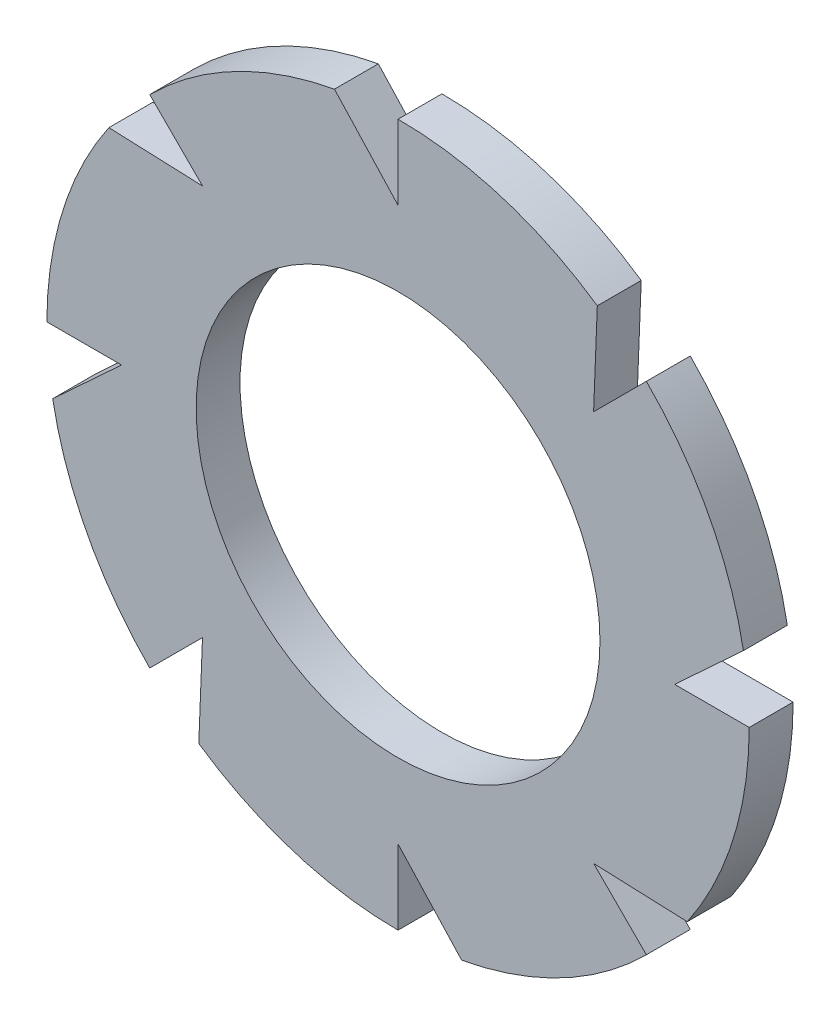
from build123d import *

# Parameters (mm, degrees)
SKETCH1_R          = 4
SKETCH1_R_2        = 2.3
BASE_EXTRUDE_DEPTH = 0.5
TYPEASLOT_DEPTH    = 8.913777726
TYPEAPATTERN_COUNT = 8


with BuildPart() as part:
    # Sketch1 → Base-Extrude (new body)
    with BuildSketch(Plane.XY):
        Circle(SKETCH1_R)
        Circle(SKETCH1_R_2, mode=Mode.SUBTRACT)
    extrude(amount=-BASE_EXTRUDE_DEPTH)

    # Sketch2 → TypeASlot (cut, through all)
    with BuildSketch(Plane(origin=(-0.6669983, 2.371577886, 0), x_dir=(1, 0, 0), z_dir=(0, 0, 1))):
        Polygon((0.6669983, 1.628422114), (0.6669983, 0.778422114), (-0.1183992, 1.628422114), align=None)
    typeaslot = extrude(amount=-TYPEASLOT_DEPTH, mode=Mode.SUBTRACT)

    # TypeAPattern: TypeASlot ×8 about axis
    typeapattern_axis = Axis((0, 0, 0), (0, 0, 1))
    for i in range(1, TYPEAPATTERN_COUNT):
        add(typeaslot.rotate(typeapattern_axis, i * 360 / TYPEAPATTERN_COUNT), mode=Mode.SUBTRACT)


solid = part.part
